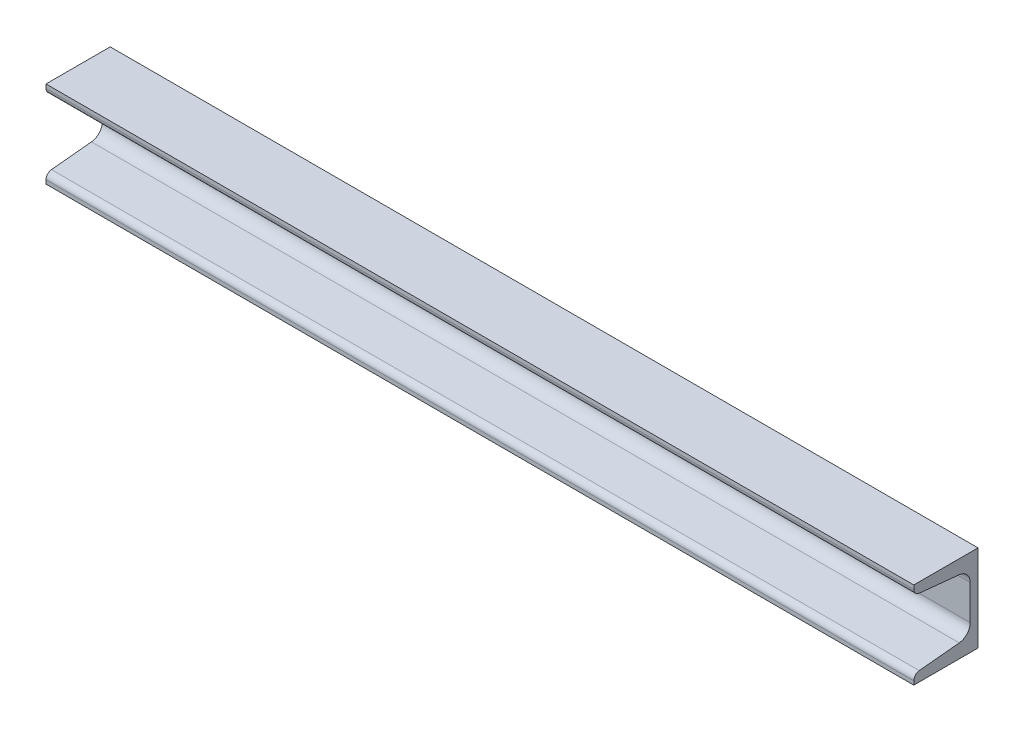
from build123d import *

# Parameters (mm, degrees)
BASE_DEPTH = 500
FILLET1_R  = 7
FILLET2_R  = 3.5


with BuildPart() as part:
    # Sketch1 → Base (new body)
    with BuildSketch(Plane(origin=(0, 0, -28.211262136), x_dir=(0, 0, 1), z_dir=(1, 0, 0))):
        Polygon((28.211262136, -25), (28.211262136, 25), (65.211262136, 25), (65.211262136, 19.625), (32.711262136, 16.375), (32.711262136, -16.375), (65.211262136, -19.625), (65.211262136, -25), align=None)
    extrude(amount=BASE_DEPTH)

    # Fillet1
    fillet1_edges = [part.edges().sort_by_distance(p)[0] for p in [
        (250, -16.375, 4.5),
        (250, 16.375, 4.5),
    ]]
    fillet(fillet1_edges, radius=FILLET1_R)

    # Fillet2
    fillet2_edges = [part.edges().sort_by_distance(p)[0] for p in [
        (250, 19.625, 37),
        (250, -19.625, 37),
    ]]
    fillet(fillet2_edges, radius=FILLET2_R)


solid = part.part
